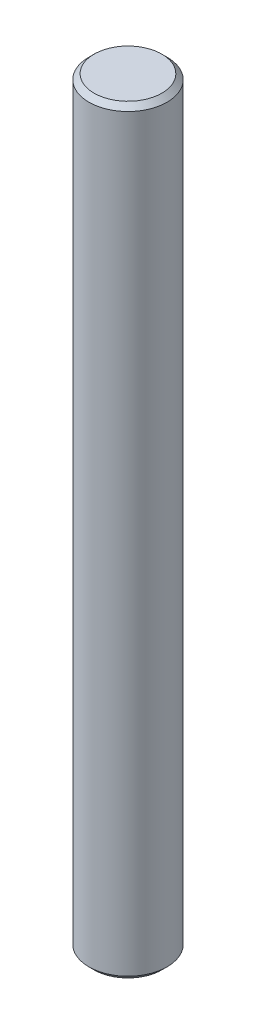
from build123d import *

# Parameters (mm, degrees)
SKETCH_2_R      = 0.75
EXTRUDE_1_DEPTH = 7.2875
CHAMFER_1_SIZE  = 0.1


with BuildPart() as part:
    # Sketch 2 → Extrude 1 (new, symmetric)
    with BuildSketch(Plane(origin=(0, 0, 0), x_dir=(1, 0, 0), z_dir=(0, 1, 0))):
        with Locations(Location((0, 0, 0), (0, 0, 270))):
            Circle(SKETCH_2_R)
    extrude(amount=EXTRUDE_1_DEPTH, both=True)

    # Chamfer 1
    chamfer_1_edges = [part.edges().sort_by_distance(p)[0] for p in [
        (0, -7.2875, -0.75),
        (0, 7.2875, -0.75),
    ]]
    chamfer(chamfer_1_edges, length=CHAMFER_1_SIZE)


solid = part.part
